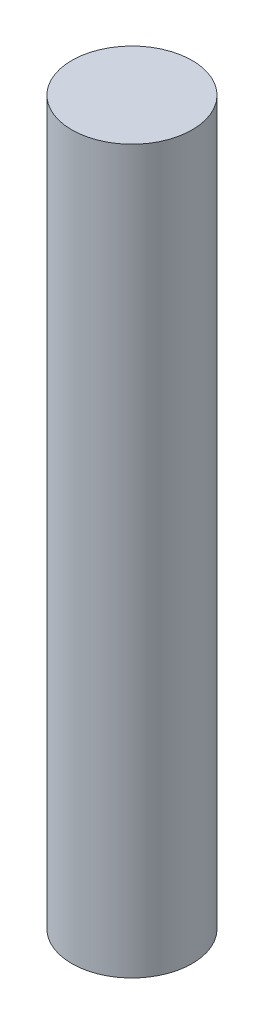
from build123d import *

# Parameters (mm, degrees)
CROQUIS1_R              = 2.5
SALIENTE_EXTRUIR1_DEPTH = 15


with BuildPart() as part:
    # Croquis1 → Saliente-Extruir1 (new, symmetric)
    with BuildSketch(Plane(origin=(0, 0, 0), x_dir=(1, 0, 0), z_dir=(0, 1, 0))):
        with Locations(Location((0, 0, 0), (0, 0, 270))):
            Circle(CROQUIS1_R)
    extrude(amount=SALIENTE_EXTRUIR1_DEPTH, both=True)


solid = part.part
